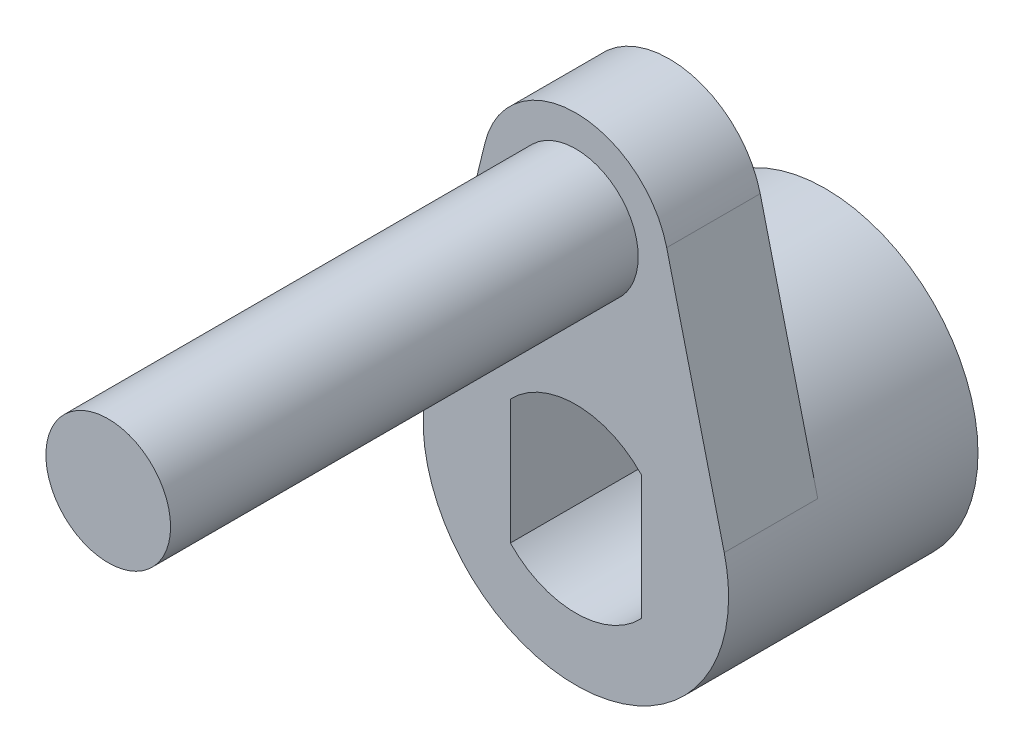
from build123d import *

# Parameters (mm, degrees)
ESQUISSE1_R        = 4.9
BOSS_EXTRU_1_DEPTH = 8
BOSS_EXTRU_2_DEPTH = 3
ESQUISSE3_R        = 2
BOSS_EXTRU_3_DEPTH = 15


with BuildPart() as part:
    # Esquisse1 → Boss.-Extru.1 (new body)
    with BuildSketch(Plane.XY):
        with Locations((-25.8, 0)):
            Circle(ESQUISSE1_R)
        with BuildLine():
            Line((-23.7, -2), (-23.7, 2))
            ThreePointArc((-23.7, 2), (-25.8, 2.9), (-27.9, 2))
            Line((-27.9, 2), (-27.9, -2))
            ThreePointArc((-27.9, -2), (-25.8, -2.9), (-23.7, -2))
        make_face(mode=Mode.SUBTRACT)
    extrude(amount=-BOSS_EXTRU_1_DEPTH)

    # Esquisse2 → Boss.-Extru.2 (add)
    with BuildSketch(Plane.XY):
        with BuildLine():
            Line((-21.040201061, 1.16375), (-22.885837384, 8.7125))
            ThreePointArc((-22.885837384, 8.7125), (-25.8, 11), (-28.714162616, 8.7125))
            Line((-28.714162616, 8.7125), (-30.559798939, 1.16375))
            ThreePointArc((-30.559798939, 1.16375), (-25.8, -4.9), (-21.040201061, 1.16375))
        make_face()
        with BuildLine():
            Line((-27.9, 2), (-27.9, -2))
            ThreePointArc((-27.9, -2), (-25.8, -2.9), (-23.7, -2))
            Line((-23.7, -2), (-23.7, 2))
            ThreePointArc((-23.7, 2), (-25.8, 2.9), (-27.9, 2))
        make_face(mode=Mode.SUBTRACT)
    extrude(amount=-BOSS_EXTRU_2_DEPTH)

    # Esquisse3 → Boss.-Extru.3 (add)
    with BuildSketch(Plane.XY):
        with Locations((-25.8, 8)):
            Circle(ESQUISSE3_R)
    extrude(amount=BOSS_EXTRU_3_DEPTH)


solid = part.part
